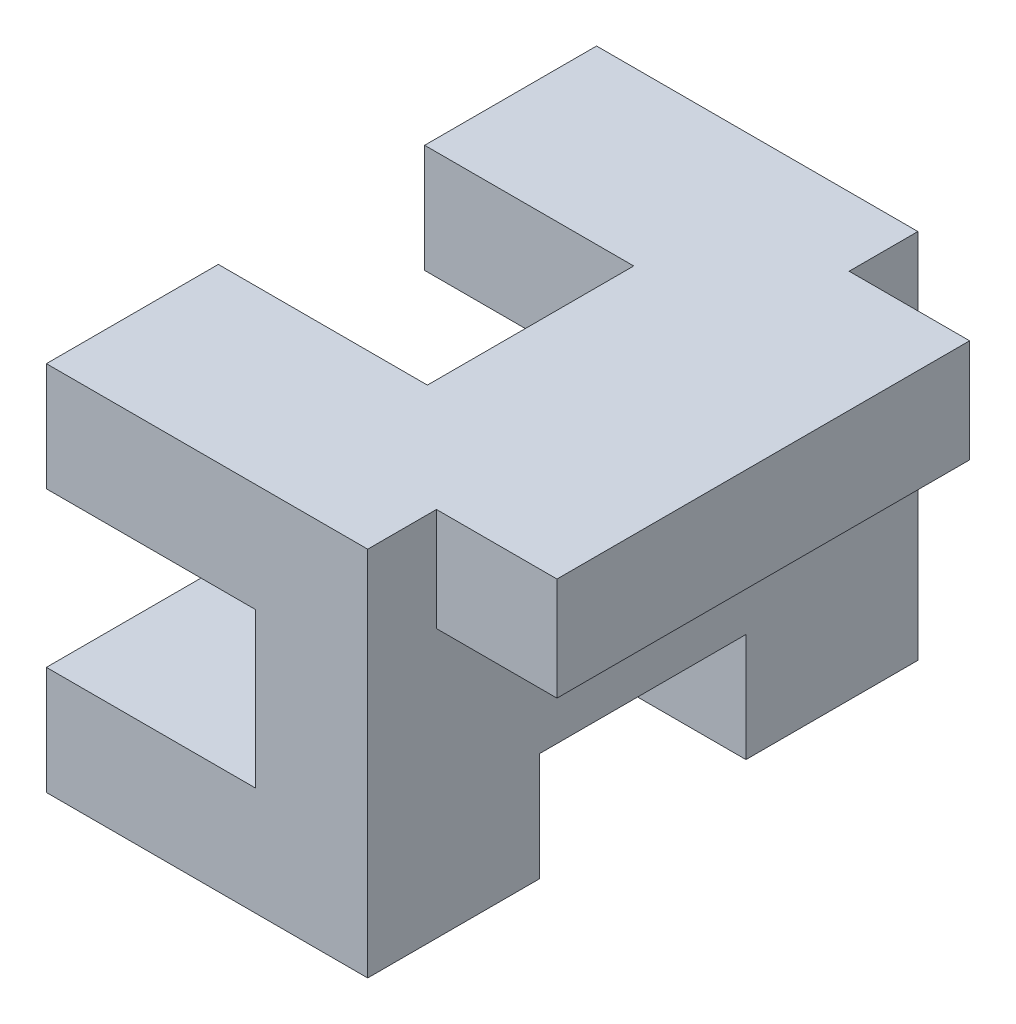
from build123d import *

# Parameters (mm, degrees)
BASE_EXTRUDE_DEPTH      = 25.4
CUT_EXTRUDE1_DEPTH      = 44.007600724
CUT_EXTRUDE1_DEPTH_BACK = 44.007600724
SKETCH2_W               = 19.812
SKETCH2_H               = 19.05
SKETCH3_W               = 19.05
SKETCH3_H               = 10.0076
CUT_EXTRUDE2_DEPTH      = 44.007600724
CHAMFER1_SIZE           = 0.508
SKETCH4_W               = 11.1252
SKETCH4_H               = 6.35
CUT_EXTRUDE3_DEPTH      = 53.263819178


with BuildPart() as part:
    # Sketch1 → Base-Extrude (new, symmetric)
    with BuildSketch(Plane.XY):
        Polygon((-30.1752, 17.145), (-30.1752, 7.1374), (-10.3632, 7.1374), (-10.3632, -7.1374), (-30.1752, -7.1374), (-30.1752, -17.145), (0, -17.145), (0, 7.62), (11.1252, 7.62), (11.1252, 17.145), align=None)
    extrude(amount=BASE_EXTRUDE_DEPTH, both=True)

    # Sketch2 → Cut-Extrude1 (cut, two sides: drawn at the far end of the back side and taken through both)
    with BuildSketch(Plane(origin=(0, 0, 0), x_dir=(1, 0, 0), z_dir=(0, 1, 0)).offset(-CUT_EXTRUDE1_DEPTH_BACK)):
        with Locations((-20.2692, 0)):
            Rectangle(SKETCH2_W, SKETCH2_H)
    extrude(amount=CUT_EXTRUDE1_DEPTH + CUT_EXTRUDE1_DEPTH_BACK, mode=Mode.SUBTRACT)

    # Sketch3 → Cut-Extrude2 (cut, through all)
    with BuildSketch(Plane(origin=(0, 0, 0), x_dir=(0, 0, -1), z_dir=(1, 0, 0))):
        with Locations((0, -12.1412)):
            Rectangle(SKETCH3_W, SKETCH3_H)
    extrude(amount=-CUT_EXTRUDE2_DEPTH, mode=Mode.SUBTRACT)

    # Chamfer1
    chamfer1_edges = [part.edges().sort_by_distance(p)[0] for p in [
        (-30.1752, 17.145, -17.4625),
        (-30.1752, 12.1412, -9.525),
        (-30.1752, 7.1374, -17.4625),
        (-30.1752, 12.1412, -25.4),
        (-30.1752, -12.1412, -25.4),
        (-30.1752, 12.1412, 25.4),
        (-30.1752, -12.1412, 25.4),
        (-30.1752, -17.145, 17.4625),
        (-30.1752, -12.1412, 9.525),
        (-30.1752, -12.1412, -9.525),
        (-30.1752, -7.1374, 17.4625),
        (-30.1752, 7.1374, 17.4625),
        (-30.1752, 12.1412, 9.525),
        (-30.1752, 17.145, 17.4625),
        (-30.1752, -17.145, -17.4625),
        (-30.1752, -7.1374, -17.4625),
    ]]
    chamfer(chamfer1_edges, length=CHAMFER1_SIZE)

    # Sketch4 → Cut-Extrude3 (cut, through all)
    with BuildSketch(Plane(origin=(0, 17.145, 0), x_dir=(-1, 0, 0), z_dir=(0, 1, 0))):
        with Locations((-5.5626, 22.225)):
            Rectangle(SKETCH4_W, SKETCH4_H)
        with Locations((-5.5626, -22.225)):
            Rectangle(SKETCH4_W, SKETCH4_H)
    extrude(amount=-CUT_EXTRUDE3_DEPTH, mode=Mode.SUBTRACT)


solid = part.part
